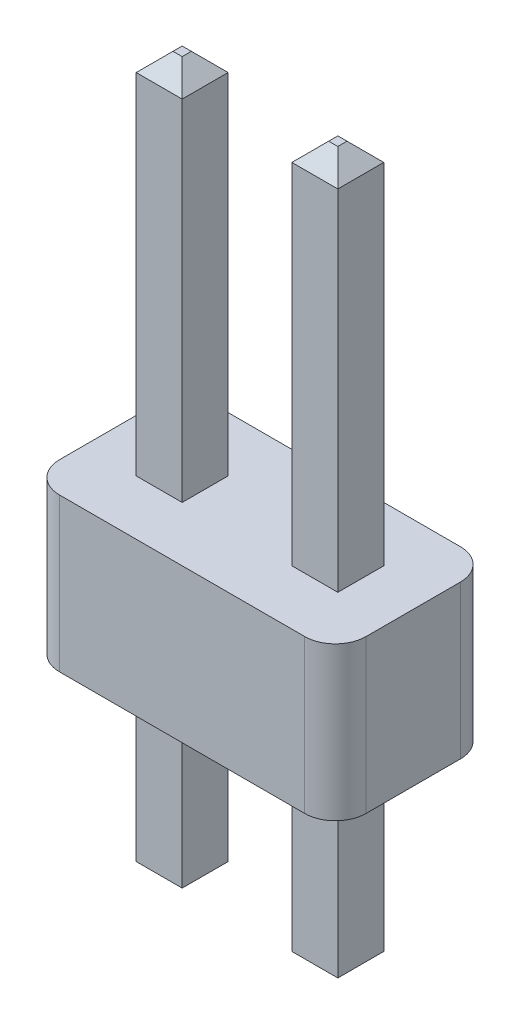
from build123d import *

# Parameters (mm, degrees)
BOSS_EXTRUDE1_DEPTH      = 2.5
BOSS_EXTRUDE2_DEPTH      = 8.5
BOSS_EXTRUDE2_DEPTH_BACK = 3.25
SKETCH2_W                = 0.75
SKETCH2_H                = 0.75
CHAMFER1_SIZE            = 0.3


with BuildPart() as part:
    # Sketch1 → Boss-Extrude1 (new body)
    with BuildSketch(Plane(origin=(0, 0, 0), x_dir=(-1, 0, 0), z_dir=(0, 1, 0))):
        with BuildLine():
            Line((-2, 1.27), (2, 1.27))
            ThreePointArc((2, 1.27), (2.353553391, 1.123553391), (2.5, 0.77))
            Line((2.5, 0.77), (2.5, -0.77))
            ThreePointArc((2.5, -0.77), (2.353553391, -1.123553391), (2, -1.27))
            Line((2, -1.27), (-2, -1.27))
            ThreePointArc((-2, -1.27), (-2.353553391, -1.123553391), (-2.5, -0.77))
            Line((-2.5, -0.77), (-2.5, 0.77))
            ThreePointArc((-2.5, 0.77), (-2.353553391, 1.123553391), (-2, 1.27))
        make_face()
    extrude(amount=BOSS_EXTRUDE1_DEPTH)

    # Sketch2 → Boss-Extrude2 (add, two sides: drawn at the far end of the back side and taken through both)
    with BuildSketch(Plane(origin=(0, 0, 0), x_dir=(-1, 0, 0), z_dir=(0, 1, 0)).offset(-BOSS_EXTRUDE2_DEPTH_BACK)):
        with Locations((1.27, 0)):
            Rectangle(SKETCH2_W, SKETCH2_H)
        with Locations((-1.27, 0)):
            Rectangle(SKETCH2_W, SKETCH2_H)
    extrude(amount=BOSS_EXTRUDE2_DEPTH + BOSS_EXTRUDE2_DEPTH_BACK)

    # Chamfer1
    chamfer1_edges = [part.edges().sort_by_distance(p)[0] for p in [
        (-0.895, -3.25, 0),
        (-1.27, -3.25, 0.375),
        (-1.645, -3.25, 0),
        (-1.27, -3.25, -0.375),
        (-0.895, 8.5, 0),
        (-1.27, 8.5, -0.375),
        (-1.645, 8.5, 0),
        (-1.27, 8.5, 0.375),
        (0.895, -3.25, 0),
        (1.27, -3.25, -0.375),
        (1.645, -3.25, 0),
        (1.27, -3.25, 0.375),
        (0.895, 8.5, 0),
        (1.27, 8.5, 0.375),
        (1.645, 8.5, 0),
        (1.27, 8.5, -0.375),
    ]]
    chamfer(chamfer1_edges, length=CHAMFER1_SIZE)


solid = part.part
